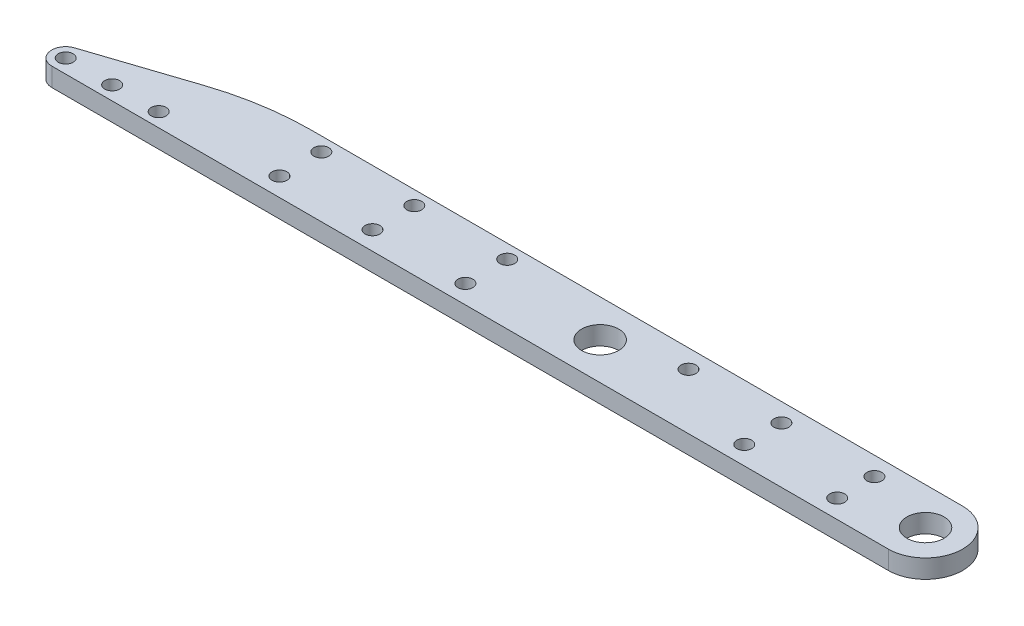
ISO-10303-21;
HEADER;
FILE_DESCRIPTION(('STEP AP214'),'2;1');
FILE_NAME('part.step','',(''),(''),'','','');
FILE_SCHEMA(('AUTOMOTIVE_DESIGN { 1 0 10303 214 1 1 1 1 }'));
ENDSEC;
DATA;
#1=APPLICATION_CONTEXT('core data for automotive mechanical design processes');
#2=APPLICATION_PROTOCOL_DEFINITION('international standard','automotive_design',2000,#1);
#3=PRODUCT_CONTEXT('',#1,'mechanical');
#4=PRODUCT('Part','Part','',(#3));
#5=PRODUCT_RELATED_PRODUCT_CATEGORY('part','',(#4));
#6=PRODUCT_DEFINITION_FORMATION('','',#4);
#7=PRODUCT_DEFINITION_CONTEXT('part definition',#1,'design');
#8=PRODUCT_DEFINITION('design','',#6,#7);
#9=PRODUCT_DEFINITION_SHAPE('','',#8);
#10=(LENGTH_UNIT() NAMED_UNIT(*) SI_UNIT(.MILLI.,.METRE.));
#11=(NAMED_UNIT(*) PLANE_ANGLE_UNIT() SI_UNIT($,.RADIAN.));
#12=(NAMED_UNIT(*) SI_UNIT($,.STERADIAN.) SOLID_ANGLE_UNIT());
#13=UNCERTAINTY_MEASURE_WITH_UNIT(LENGTH_MEASURE(1.E-05),#10,'distance_accuracy_value','');
#14=(GEOMETRIC_REPRESENTATION_CONTEXT(3) GLOBAL_UNCERTAINTY_ASSIGNED_CONTEXT((#13)) GLOBAL_UNIT_ASSIGNED_CONTEXT((#10,
#11,#12)) REPRESENTATION_CONTEXT('',''));
#15=CARTESIAN_POINT('',(0.,0.,0.));
#16=DIRECTION('',(0.,0.,1.));
#17=DIRECTION('',(1.,0.,0.));
#18=AXIS2_PLACEMENT_3D('',#15,#16,#17);
#19=CARTESIAN_POINT('',(0.,4.,0.));
#20=DIRECTION('',(0.,-1.,0.));
#21=DIRECTION('',(0.,0.,-1.));
#22=AXIS2_PLACEMENT_3D('',#19,#20,#21);
#23=PLANE('',#22);
#24=CARTESIAN_POINT('',(-94.9999999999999,4.,4.));
#25=DIRECTION('',(0.,1.,0.));
#26=DIRECTION('',(0.,0.,1.));
#27=AXIS2_PLACEMENT_3D('',#24,#25,#26);
#28=CIRCLE('',#27,1.60000000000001);
#29=CARTESIAN_POINT('',(-94.9999999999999,4.,5.60000000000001));
#30=VERTEX_POINT('',#29);
#31=EDGE_CURVE('E264',#30,#30,#28,.T.);
#32=ORIENTED_EDGE('',*,*,#31,.F.);
#33=EDGE_LOOP('',(#32));
#34=FACE_BOUND('',#33,.T.);
#35=CARTESIAN_POINT('',(-35.,4.,4.));
#36=DIRECTION('',(0.,1.,0.));
#37=DIRECTION('',(0.,0.,1.));
#38=AXIS2_PLACEMENT_3D('',#35,#36,#37);
#39=CIRCLE('',#38,1.60000000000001);
#40=CARTESIAN_POINT('',(-35.,4.,5.60000000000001));
#41=VERTEX_POINT('',#40);
#42=EDGE_CURVE('E271',#41,#41,#39,.T.);
#43=ORIENTED_EDGE('',*,*,#42,.F.);
#44=EDGE_LOOP('',(#43));
#45=FACE_BOUND('',#44,.T.);
#46=CARTESIAN_POINT('',(-14.9999999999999,4.,4.));
#47=DIRECTION('',(0.,1.,0.));
#48=DIRECTION('',(0.,0.,1.));
#49=AXIS2_PLACEMENT_3D('',#46,#47,#48);
#50=CIRCLE('',#49,1.60000000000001);
#51=CARTESIAN_POINT('',(-14.9999999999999,4.,5.60000000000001));
#52=VERTEX_POINT('',#51);
#53=EDGE_CURVE('E255',#52,#52,#50,.T.);
#54=ORIENTED_EDGE('',*,*,#53,.F.);
#55=EDGE_LOOP('',(#54));
#56=FACE_BOUND('',#55,.T.);
#57=CARTESIAN_POINT('',(-55.,4.,-3.99999999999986));
#58=DIRECTION('',(0.,1.,0.));
#59=DIRECTION('',(0.,0.,1.));
#60=AXIS2_PLACEMENT_3D('',#57,#58,#59);
#61=CIRCLE('',#60,1.59999999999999);
#62=CARTESIAN_POINT('',(-55.,4.,-2.39999999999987));
#63=VERTEX_POINT('',#62);
#64=EDGE_CURVE('E245',#63,#63,#61,.T.);
#65=ORIENTED_EDGE('',*,*,#64,.F.);
#66=EDGE_LOOP('',(#65));
#67=FACE_BOUND('',#66,.T.);
#68=CARTESIAN_POINT('',(-115.,4.,4.));
#69=DIRECTION('',(0.,1.,0.));
#70=DIRECTION('',(0.,0.,1.));
#71=AXIS2_PLACEMENT_3D('',#68,#69,#70);
#72=CIRCLE('',#71,1.60000000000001);
#73=CARTESIAN_POINT('',(-115.,4.,5.60000000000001));
#74=VERTEX_POINT('',#73);
#75=EDGE_CURVE('E295',#74,#74,#72,.T.);
#76=ORIENTED_EDGE('',*,*,#75,.F.);
#77=EDGE_LOOP('',(#76));
#78=FACE_BOUND('',#77,.T.);
#79=CARTESIAN_POINT('',(-135.,4.,4.));
#80=DIRECTION('',(0.,1.,0.));
#81=DIRECTION('',(0.,0.,1.));
#82=AXIS2_PLACEMENT_3D('',#79,#80,#81);
#83=CIRCLE('',#82,1.59999999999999);
#84=CARTESIAN_POINT('',(-135.,4.,5.59999999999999));
#85=VERTEX_POINT('',#84);
#86=EDGE_CURVE('E289',#85,#85,#83,.T.);
#87=ORIENTED_EDGE('',*,*,#86,.F.);
#88=EDGE_LOOP('',(#87));
#89=FACE_BOUND('',#88,.T.);
#90=CARTESIAN_POINT('',(-95.,4.,-5.));
#91=DIRECTION('',(0.,1.,0.));
#92=DIRECTION('',(0.,0.,1.));
#93=AXIS2_PLACEMENT_3D('',#90,#91,#92);
#94=CIRCLE('',#93,1.60000000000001);
#95=CARTESIAN_POINT('',(-95.,4.,-3.4));
#96=VERTEX_POINT('',#95);
#97=EDGE_CURVE('E283',#96,#96,#94,.T.);
#98=ORIENTED_EDGE('',*,*,#97,.F.);
#99=EDGE_LOOP('',(#98));
#100=FACE_BOUND('',#99,.T.);
#101=CARTESIAN_POINT('',(-115.,4.,-5.));
#102=DIRECTION('',(0.,1.,0.));
#103=DIRECTION('',(0.,0.,1.));
#104=AXIS2_PLACEMENT_3D('',#101,#102,#103);
#105=CIRCLE('',#104,1.60000000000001);
#106=CARTESIAN_POINT('',(-115.,4.,-3.4));
#107=VERTEX_POINT('',#106);
#108=EDGE_CURVE('E276',#107,#107,#105,.T.);
#109=ORIENTED_EDGE('',*,*,#108,.F.);
#110=EDGE_LOOP('',(#109));
#111=FACE_BOUND('',#110,.T.);
#112=CARTESIAN_POINT('',(-35.,4.,-3.99999999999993));
#113=DIRECTION('',(0.,1.,0.));
#114=DIRECTION('',(0.,0.,1.));
#115=AXIS2_PLACEMENT_3D('',#112,#113,#114);
#116=CIRCLE('',#115,1.60000000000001);
#117=CARTESIAN_POINT('',(-35.,4.,-2.39999999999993));
#118=VERTEX_POINT('',#117);
#119=EDGE_CURVE('E240',#118,#118,#116,.T.);
#120=ORIENTED_EDGE('',*,*,#119,.F.);
#121=EDGE_LOOP('',(#120));
#122=FACE_BOUND('',#121,.T.);
#123=CARTESIAN_POINT('',(-15.,4.,-4.));
#124=DIRECTION('',(0.,1.,0.));
#125=DIRECTION('',(0.,0.,1.));
#126=AXIS2_PLACEMENT_3D('',#123,#124,#125);
#127=CIRCLE('',#126,1.60000000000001);
#128=CARTESIAN_POINT('',(-15.,4.,-2.4));
#129=VERTEX_POINT('',#128);
#130=EDGE_CURVE('E247',#129,#129,#127,.T.);
#131=ORIENTED_EDGE('',*,*,#130,.F.);
#132=EDGE_LOOP('',(#131));
#133=FACE_BOUND('',#132,.T.);
#134=CARTESIAN_POINT('',(-135.,4.,-5.));
#135=DIRECTION('',(0.,1.,0.));
#136=DIRECTION('',(0.,0.,1.));
#137=AXIS2_PLACEMENT_3D('',#134,#135,#136);
#138=CIRCLE('',#137,1.59999999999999);
#139=CARTESIAN_POINT('',(-135.,4.,-3.40000000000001));
#140=VERTEX_POINT('',#139);
#141=EDGE_CURVE('E279',#140,#140,#138,.T.);
#142=ORIENTED_EDGE('',*,*,#141,.F.);
#143=EDGE_LOOP('',(#142));
#144=FACE_BOUND('',#143,.T.);
#145=CARTESIAN_POINT('',(0.,4.,0.));
#146=DIRECTION('',(0.,1.,0.));
#147=DIRECTION('',(0.,0.,-1.));
#148=AXIS2_PLACEMENT_3D('',#145,#146,#147);
#149=CIRCLE('',#148,8.);
#150=CARTESIAN_POINT('',(0.,4.,8.));
#151=VERTEX_POINT('',#150);
#152=CARTESIAN_POINT('',(0.,4.,-8.));
#153=VERTEX_POINT('',#152);
#154=EDGE_CURVE('E137',#151,#153,#149,.T.);
#155=ORIENTED_EDGE('',*,*,#154,.T.);
#156=DIRECTION('',(-1.,0.,0.));
#157=VECTOR('',#156,1.);
#158=CARTESIAN_POINT('',(-140.,4.,-8.00000000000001));
#159=LINE('',#158,#157);
#160=CARTESIAN_POINT('',(-140.,4.,-8.00000000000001));
#161=VERTEX_POINT('',#160);
#162=EDGE_CURVE('E95',#153,#161,#159,.T.);
#163=ORIENTED_EDGE('',*,*,#162,.T.);
#164=CARTESIAN_POINT('',(-140.,4.,55.6702644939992));
#165=DIRECTION('',(0.,1.,0.));
#166=DIRECTION('',(0.,0.,-1.));
#167=AXIS2_PLACEMENT_3D('',#164,#165,#166);
#168=CIRCLE('',#167,63.6702644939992);
#169=CARTESIAN_POINT('',(-160.,4.,-4.77725473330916));
#170=VERTEX_POINT('',#169);
#171=EDGE_CURVE('E108',#161,#170,#168,.T.);
#172=ORIENTED_EDGE('',*,*,#171,.T.);
#173=DIRECTION('',(-0.94938382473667,0.,0.314118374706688));
#174=VECTOR('',#173,1.);
#175=CARTESIAN_POINT('',(-180.94235512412,4.,2.15184852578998));
#176=LINE('',#175,#174);
#177=CARTESIAN_POINT('',(-180.94235512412,4.,2.15184852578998));
#178=VERTEX_POINT('',#177);
#179=EDGE_CURVE('E102',#170,#178,#176,.T.);
#180=ORIENTED_EDGE('',*,*,#179,.T.);
#181=CARTESIAN_POINT('',(-180.,4.,5.));
#182=DIRECTION('',(0.,1.,0.));
#183=DIRECTION('',(0.,0.,-1.));
#184=AXIS2_PLACEMENT_3D('',#181,#182,#183);
#185=CIRCLE('',#184,3.);
#186=CARTESIAN_POINT('',(-180.,4.,8.));
#187=VERTEX_POINT('',#186);
#188=EDGE_CURVE('E106',#178,#187,#185,.T.);
#189=ORIENTED_EDGE('',*,*,#188,.T.);
#190=DIRECTION('',(1.,0.,0.));
#191=VECTOR('',#190,1.);
#192=CARTESIAN_POINT('',(0.,4.,8.));
#193=LINE('',#192,#191);
#194=EDGE_CURVE('E58',#187,#151,#193,.T.);
#195=ORIENTED_EDGE('',*,*,#194,.T.);
#196=EDGE_LOOP('',(#155,#163,#172,#180,#189,#195));
#197=FACE_BOUND('',#196,.T.);
#198=CARTESIAN_POINT('',(0.,4.,0.));
#199=DIRECTION('',(0.,1.,0.));
#200=DIRECTION('',(0.,0.,1.));
#201=AXIS2_PLACEMENT_3D('',#198,#199,#200);
#202=CIRCLE('',#201,4.);
#203=CARTESIAN_POINT('',(0.,4.,4.));
#204=VERTEX_POINT('',#203);
#205=EDGE_CURVE('E130',#204,#204,#202,.T.);
#206=ORIENTED_EDGE('',*,*,#205,.F.);
#207=EDGE_LOOP('',(#206));
#208=FACE_BOUND('',#207,.T.);
#209=CARTESIAN_POINT('',(-70.,4.,0.));
#210=DIRECTION('',(0.,1.,0.));
#211=DIRECTION('',(0.,0.,1.));
#212=AXIS2_PLACEMENT_3D('',#209,#210,#211);
#213=CIRCLE('',#212,4.00000000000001);
#214=CARTESIAN_POINT('',(-70.,4.,4.00000000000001));
#215=VERTEX_POINT('',#214);
#216=EDGE_CURVE('E324',#215,#215,#213,.T.);
#217=ORIENTED_EDGE('',*,*,#216,.F.);
#218=EDGE_LOOP('',(#217));
#219=FACE_BOUND('',#218,.T.);
#220=CARTESIAN_POINT('',(-180.,4.,5.));
#221=DIRECTION('',(0.,1.,0.));
#222=DIRECTION('',(0.,0.,1.));
#223=AXIS2_PLACEMENT_3D('',#220,#221,#222);
#224=CIRCLE('',#223,1.59999999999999);
#225=CARTESIAN_POINT('',(-180.,4.,6.59999999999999));
#226=VERTEX_POINT('',#225);
#227=EDGE_CURVE('E318',#226,#226,#224,.T.);
#228=ORIENTED_EDGE('',*,*,#227,.F.);
#229=EDGE_LOOP('',(#228));
#230=FACE_BOUND('',#229,.T.);
#231=CARTESIAN_POINT('',(-170.,4.,5.));
#232=DIRECTION('',(0.,1.,0.));
#233=DIRECTION('',(0.,0.,1.));
#234=AXIS2_PLACEMENT_3D('',#231,#232,#233);
#235=CIRCLE('',#234,1.59999999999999);
#236=CARTESIAN_POINT('',(-170.,4.,6.59999999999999));
#237=VERTEX_POINT('',#236);
#238=EDGE_CURVE('E312',#237,#237,#235,.T.);
#239=ORIENTED_EDGE('',*,*,#238,.F.);
#240=EDGE_LOOP('',(#239));
#241=FACE_BOUND('',#240,.T.);
#242=CARTESIAN_POINT('',(-160.,4.,5.));
#243=DIRECTION('',(0.,1.,0.));
#244=DIRECTION('',(0.,0.,1.));
#245=AXIS2_PLACEMENT_3D('',#242,#243,#244);
#246=CIRCLE('',#245,1.60000000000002);
#247=CARTESIAN_POINT('',(-160.,4.,6.60000000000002));
#248=VERTEX_POINT('',#247);
#249=EDGE_CURVE('E306',#248,#248,#246,.T.);
#250=ORIENTED_EDGE('',*,*,#249,.F.);
#251=EDGE_LOOP('',(#250));
#252=FACE_BOUND('',#251,.T.);
#253=ADVANCED_FACE('F41',(#34,#45,#56,#67,#78,#89,#100,#111,#122,#133,#144,#197,#208,#219,#230,
#241,#252),#23,.F.);
#254=CARTESIAN_POINT('',(0.,0.,0.));
#255=DIRECTION('',(0.,-1.,0.));
#256=DIRECTION('',(0.,0.,-1.));
#257=AXIS2_PLACEMENT_3D('',#254,#255,#256);
#258=PLANE('',#257);
#259=CARTESIAN_POINT('',(-94.9999999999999,0.,4.));
#260=DIRECTION('',(0.,1.,0.));
#261=DIRECTION('',(0.,0.,1.));
#262=AXIS2_PLACEMENT_3D('',#259,#260,#261);
#263=CIRCLE('',#262,1.60000000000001);
#264=CARTESIAN_POINT('',(-94.9999999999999,0.,5.60000000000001));
#265=VERTEX_POINT('',#264);
#266=EDGE_CURVE('E268',#265,#265,#263,.T.);
#267=ORIENTED_EDGE('',*,*,#266,.T.);
#268=EDGE_LOOP('',(#267));
#269=FACE_BOUND('',#268,.T.);
#270=CARTESIAN_POINT('',(-35.,0.,4.));
#271=DIRECTION('',(0.,1.,0.));
#272=DIRECTION('',(0.,0.,1.));
#273=AXIS2_PLACEMENT_3D('',#270,#271,#272);
#274=CIRCLE('',#273,1.60000000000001);
#275=CARTESIAN_POINT('',(-35.,0.,5.60000000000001));
#276=VERTEX_POINT('',#275);
#277=EDGE_CURVE('E258',#276,#276,#274,.T.);
#278=ORIENTED_EDGE('',*,*,#277,.T.);
#279=EDGE_LOOP('',(#278));
#280=FACE_BOUND('',#279,.T.);
#281=CARTESIAN_POINT('',(-14.9999999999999,0.,4.));
#282=DIRECTION('',(0.,1.,0.));
#283=DIRECTION('',(0.,0.,1.));
#284=AXIS2_PLACEMENT_3D('',#281,#282,#283);
#285=CIRCLE('',#284,1.60000000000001);
#286=CARTESIAN_POINT('',(-14.9999999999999,0.,5.60000000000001));
#287=VERTEX_POINT('',#286);
#288=EDGE_CURVE('E259',#287,#287,#285,.T.);
#289=ORIENTED_EDGE('',*,*,#288,.T.);
#290=EDGE_LOOP('',(#289));
#291=FACE_BOUND('',#290,.T.);
#292=CARTESIAN_POINT('',(-55.,0.,-3.99999999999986));
#293=DIRECTION('',(0.,1.,0.));
#294=DIRECTION('',(0.,0.,1.));
#295=AXIS2_PLACEMENT_3D('',#292,#293,#294);
#296=CIRCLE('',#295,1.59999999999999);
#297=CARTESIAN_POINT('',(-55.,0.,-2.39999999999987));
#298=VERTEX_POINT('',#297);
#299=EDGE_CURVE('E242',#298,#298,#296,.T.);
#300=ORIENTED_EDGE('',*,*,#299,.T.);
#301=EDGE_LOOP('',(#300));
#302=FACE_BOUND('',#301,.T.);
#303=CARTESIAN_POINT('',(-115.,0.,4.));
#304=DIRECTION('',(0.,1.,0.));
#305=DIRECTION('',(0.,0.,1.));
#306=AXIS2_PLACEMENT_3D('',#303,#304,#305);
#307=CIRCLE('',#306,1.60000000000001);
#308=CARTESIAN_POINT('',(-115.,0.,5.60000000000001));
#309=VERTEX_POINT('',#308);
#310=EDGE_CURVE('E267',#309,#309,#307,.T.);
#311=ORIENTED_EDGE('',*,*,#310,.T.);
#312=EDGE_LOOP('',(#311));
#313=FACE_BOUND('',#312,.T.);
#314=CARTESIAN_POINT('',(-135.,0.,4.));
#315=DIRECTION('',(0.,1.,0.));
#316=DIRECTION('',(0.,0.,1.));
#317=AXIS2_PLACEMENT_3D('',#314,#315,#316);
#318=CIRCLE('',#317,1.59999999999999);
#319=CARTESIAN_POINT('',(-135.,0.,5.59999999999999));
#320=VERTEX_POINT('',#319);
#321=EDGE_CURVE('E292',#320,#320,#318,.T.);
#322=ORIENTED_EDGE('',*,*,#321,.T.);
#323=EDGE_LOOP('',(#322));
#324=FACE_BOUND('',#323,.T.);
#325=CARTESIAN_POINT('',(-95.,0.,-5.));
#326=DIRECTION('',(0.,1.,0.));
#327=DIRECTION('',(0.,0.,1.));
#328=AXIS2_PLACEMENT_3D('',#325,#326,#327);
#329=CIRCLE('',#328,1.60000000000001);
#330=CARTESIAN_POINT('',(-95.,0.,-3.4));
#331=VERTEX_POINT('',#330);
#332=EDGE_CURVE('E286',#331,#331,#329,.T.);
#333=ORIENTED_EDGE('',*,*,#332,.T.);
#334=EDGE_LOOP('',(#333));
#335=FACE_BOUND('',#334,.T.);
#336=CARTESIAN_POINT('',(-115.,0.,-5.));
#337=DIRECTION('',(0.,1.,0.));
#338=DIRECTION('',(0.,0.,1.));
#339=AXIS2_PLACEMENT_3D('',#336,#337,#338);
#340=CIRCLE('',#339,1.60000000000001);
#341=CARTESIAN_POINT('',(-115.,0.,-3.4));
#342=VERTEX_POINT('',#341);
#343=EDGE_CURVE('E280',#342,#342,#340,.T.);
#344=ORIENTED_EDGE('',*,*,#343,.T.);
#345=EDGE_LOOP('',(#344));
#346=FACE_BOUND('',#345,.T.);
#347=CARTESIAN_POINT('',(-35.,0.,-3.99999999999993));
#348=DIRECTION('',(0.,1.,0.));
#349=DIRECTION('',(0.,0.,1.));
#350=AXIS2_PLACEMENT_3D('',#347,#348,#349);
#351=CIRCLE('',#350,1.60000000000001);
#352=CARTESIAN_POINT('',(-35.,0.,-2.39999999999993));
#353=VERTEX_POINT('',#352);
#354=EDGE_CURVE('E237',#353,#353,#351,.T.);
#355=ORIENTED_EDGE('',*,*,#354,.T.);
#356=EDGE_LOOP('',(#355));
#357=FACE_BOUND('',#356,.T.);
#358=CARTESIAN_POINT('',(-15.,0.,-4.));
#359=DIRECTION('',(0.,1.,0.));
#360=DIRECTION('',(0.,0.,1.));
#361=AXIS2_PLACEMENT_3D('',#358,#359,#360);
#362=CIRCLE('',#361,1.60000000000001);
#363=CARTESIAN_POINT('',(-15.,0.,-2.4));
#364=VERTEX_POINT('',#363);
#365=EDGE_CURVE('E252',#364,#364,#362,.T.);
#366=ORIENTED_EDGE('',*,*,#365,.T.);
#367=EDGE_LOOP('',(#366));
#368=FACE_BOUND('',#367,.T.);
#369=CARTESIAN_POINT('',(-135.,0.,-5.));
#370=DIRECTION('',(0.,1.,0.));
#371=DIRECTION('',(0.,0.,1.));
#372=AXIS2_PLACEMENT_3D('',#369,#370,#371);
#373=CIRCLE('',#372,1.59999999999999);
#374=CARTESIAN_POINT('',(-135.,0.,-3.40000000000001));
#375=VERTEX_POINT('',#374);
#376=EDGE_CURVE('E300',#375,#375,#373,.T.);
#377=ORIENTED_EDGE('',*,*,#376,.T.);
#378=EDGE_LOOP('',(#377));
#379=FACE_BOUND('',#378,.T.);
#380=CARTESIAN_POINT('',(-170.,0.,5.));
#381=DIRECTION('',(0.,1.,0.));
#382=DIRECTION('',(0.,0.,1.));
#383=AXIS2_PLACEMENT_3D('',#380,#381,#382);
#384=CIRCLE('',#383,1.59999999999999);
#385=CARTESIAN_POINT('',(-170.,0.,6.59999999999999));
#386=VERTEX_POINT('',#385);
#387=EDGE_CURVE('E309',#386,#386,#384,.T.);
#388=ORIENTED_EDGE('',*,*,#387,.T.);
#389=EDGE_LOOP('',(#388));
#390=FACE_BOUND('',#389,.T.);
#391=CARTESIAN_POINT('',(-70.,0.,0.));
#392=DIRECTION('',(0.,1.,0.));
#393=DIRECTION('',(0.,0.,1.));
#394=AXIS2_PLACEMENT_3D('',#391,#392,#393);
#395=CIRCLE('',#394,4.00000000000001);
#396=CARTESIAN_POINT('',(-70.,0.,4.00000000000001));
#397=VERTEX_POINT('',#396);
#398=EDGE_CURVE('E321',#397,#397,#395,.T.);
#399=ORIENTED_EDGE('',*,*,#398,.T.);
#400=EDGE_LOOP('',(#399));
#401=FACE_BOUND('',#400,.T.);
#402=CARTESIAN_POINT('',(0.,0.,0.));
#403=DIRECTION('',(0.,1.,0.));
#404=DIRECTION('',(0.,0.,-1.));
#405=AXIS2_PLACEMENT_3D('',#402,#403,#404);
#406=CIRCLE('',#405,8.);
#407=CARTESIAN_POINT('',(0.,0.,8.));
#408=VERTEX_POINT('',#407);
#409=CARTESIAN_POINT('',(0.,0.,-8.));
#410=VERTEX_POINT('',#409);
#411=EDGE_CURVE('E126',#408,#410,#406,.T.);
#412=ORIENTED_EDGE('',*,*,#411,.F.);
#413=DIRECTION('',(1.,0.,0.));
#414=VECTOR('',#413,1.);
#415=CARTESIAN_POINT('',(0.,0.,8.));
#416=LINE('',#415,#414);
#417=CARTESIAN_POINT('',(-180.,0.,8.));
#418=VERTEX_POINT('',#417);
#419=EDGE_CURVE('E87',#418,#408,#416,.T.);
#420=ORIENTED_EDGE('',*,*,#419,.F.);
#421=CARTESIAN_POINT('',(-180.,0.,5.));
#422=DIRECTION('',(0.,1.,0.));
#423=DIRECTION('',(0.,0.,-1.));
#424=AXIS2_PLACEMENT_3D('',#421,#422,#423);
#425=CIRCLE('',#424,3.);
#426=CARTESIAN_POINT('',(-180.94235512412,0.,2.15184852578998));
#427=VERTEX_POINT('',#426);
#428=EDGE_CURVE('E81',#427,#418,#425,.T.);
#429=ORIENTED_EDGE('',*,*,#428,.F.);
#430=DIRECTION('',(-0.94938382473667,0.,0.314118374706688));
#431=VECTOR('',#430,1.);
#432=CARTESIAN_POINT('',(-180.94235512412,0.,2.15184852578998));
#433=LINE('',#432,#431);
#434=CARTESIAN_POINT('',(-160.,0.,-4.77725473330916));
#435=VERTEX_POINT('',#434);
#436=EDGE_CURVE('E116',#435,#427,#433,.T.);
#437=ORIENTED_EDGE('',*,*,#436,.F.);
#438=CARTESIAN_POINT('',(-140.,0.,55.6702644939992));
#439=DIRECTION('',(0.,1.,0.));
#440=DIRECTION('',(0.,0.,-1.));
#441=AXIS2_PLACEMENT_3D('',#438,#439,#440);
#442=CIRCLE('',#441,63.6702644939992);
#443=CARTESIAN_POINT('',(-140.,0.,-8.00000000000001));
#444=VERTEX_POINT('',#443);
#445=EDGE_CURVE('E132',#444,#435,#442,.T.);
#446=ORIENTED_EDGE('',*,*,#445,.F.);
#447=DIRECTION('',(-1.,0.,0.));
#448=VECTOR('',#447,1.);
#449=CARTESIAN_POINT('',(-140.,0.,-8.00000000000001));
#450=LINE('',#449,#448);
#451=EDGE_CURVE('E129',#410,#444,#450,.T.);
#452=ORIENTED_EDGE('',*,*,#451,.F.);
#453=EDGE_LOOP('',(#412,#420,#429,#437,#446,#452));
#454=FACE_BOUND('',#453,.T.);
#455=CARTESIAN_POINT('',(0.,0.,0.));
#456=DIRECTION('',(0.,1.,0.));
#457=DIRECTION('',(0.,0.,1.));
#458=AXIS2_PLACEMENT_3D('',#455,#456,#457);
#459=CIRCLE('',#458,4.);
#460=CARTESIAN_POINT('',(0.,0.,4.));
#461=VERTEX_POINT('',#460);
#462=EDGE_CURVE('E327',#461,#461,#459,.T.);
#463=ORIENTED_EDGE('',*,*,#462,.T.);
#464=EDGE_LOOP('',(#463));
#465=FACE_BOUND('',#464,.T.);
#466=CARTESIAN_POINT('',(-180.,0.,5.));
#467=DIRECTION('',(0.,1.,0.));
#468=DIRECTION('',(0.,0.,1.));
#469=AXIS2_PLACEMENT_3D('',#466,#467,#468);
#470=CIRCLE('',#469,1.59999999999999);
#471=CARTESIAN_POINT('',(-180.,0.,6.59999999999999));
#472=VERTEX_POINT('',#471);
#473=EDGE_CURVE('E315',#472,#472,#470,.T.);
#474=ORIENTED_EDGE('',*,*,#473,.T.);
#475=EDGE_LOOP('',(#474));
#476=FACE_BOUND('',#475,.T.);
#477=CARTESIAN_POINT('',(-160.,0.,5.));
#478=DIRECTION('',(0.,1.,0.));
#479=DIRECTION('',(0.,0.,1.));
#480=AXIS2_PLACEMENT_3D('',#477,#478,#479);
#481=CIRCLE('',#480,1.60000000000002);
#482=CARTESIAN_POINT('',(-160.,0.,6.60000000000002));
#483=VERTEX_POINT('',#482);
#484=EDGE_CURVE('E303',#483,#483,#481,.T.);
#485=ORIENTED_EDGE('',*,*,#484,.T.);
#486=EDGE_LOOP('',(#485));
#487=FACE_BOUND('',#486,.T.);
#488=ADVANCED_FACE('F146',(#269,#280,#291,#302,#313,#324,#335,#346,#357,#368,#379,#390,#401,
#454,#465,#476,#487),#258,.T.);
#489=CARTESIAN_POINT('',(0.,4.,0.));
#490=DIRECTION('',(0.,-1.,0.));
#491=DIRECTION('',(0.,0.,-1.));
#492=AXIS2_PLACEMENT_3D('',#489,#490,#491);
#493=CYLINDRICAL_SURFACE('',#492,8.);
#494=ORIENTED_EDGE('',*,*,#411,.T.);
#495=DIRECTION('',(0.,-1.,0.));
#496=VECTOR('',#495,1.);
#497=CARTESIAN_POINT('',(0.,4.,-8.));
#498=LINE('',#497,#496);
#499=EDGE_CURVE('E11',#153,#410,#498,.T.);
#500=ORIENTED_EDGE('',*,*,#499,.F.);
#501=ORIENTED_EDGE('',*,*,#154,.F.);
#502=DIRECTION('',(0.,-1.,0.));
#503=VECTOR('',#502,1.);
#504=CARTESIAN_POINT('',(0.,4.,8.));
#505=LINE('',#504,#503);
#506=EDGE_CURVE('E122',#151,#408,#505,.T.);
#507=ORIENTED_EDGE('',*,*,#506,.T.);
#508=EDGE_LOOP('',(#494,#500,#501,#507));
#509=FACE_BOUND('',#508,.T.);
#510=ADVANCED_FACE('F43',(#509),#493,.T.);
#511=CARTESIAN_POINT('',(-140.,4.,-8.00000000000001));
#512=DIRECTION('',(0.,0.,1.));
#513=DIRECTION('',(1.,0.,0.));
#514=AXIS2_PLACEMENT_3D('',#511,#512,#513);
#515=PLANE('',#514);
#516=ORIENTED_EDGE('',*,*,#451,.T.);
#517=DIRECTION('',(0.,-1.,0.));
#518=VECTOR('',#517,1.);
#519=CARTESIAN_POINT('',(-140.,4.,-8.00000000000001));
#520=LINE('',#519,#518);
#521=EDGE_CURVE('E50',#161,#444,#520,.T.);
#522=ORIENTED_EDGE('',*,*,#521,.F.);
#523=ORIENTED_EDGE('',*,*,#162,.F.);
#524=ORIENTED_EDGE('',*,*,#499,.T.);
#525=EDGE_LOOP('',(#516,#522,#523,#524));
#526=FACE_BOUND('',#525,.T.);
#527=ADVANCED_FACE('F514',(#526),#515,.F.);
#528=CARTESIAN_POINT('',(-140.,4.,55.6702644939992));
#529=DIRECTION('',(0.,-1.,0.));
#530=DIRECTION('',(0.,0.,-1.));
#531=AXIS2_PLACEMENT_3D('',#528,#529,#530);
#532=CYLINDRICAL_SURFACE('',#531,63.6702644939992);
#533=ORIENTED_EDGE('',*,*,#445,.T.);
#534=DIRECTION('',(0.,-1.,0.));
#535=VECTOR('',#534,1.);
#536=CARTESIAN_POINT('',(-160.,4.,-4.77725473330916));
#537=LINE('',#536,#535);
#538=EDGE_CURVE('E117',#170,#435,#537,.T.);
#539=ORIENTED_EDGE('',*,*,#538,.F.);
#540=ORIENTED_EDGE('',*,*,#171,.F.);
#541=ORIENTED_EDGE('',*,*,#521,.T.);
#542=EDGE_LOOP('',(#533,#539,#540,#541));
#543=FACE_BOUND('',#542,.T.);
#544=ADVANCED_FACE('F143',(#543),#532,.T.);
#545=CARTESIAN_POINT('',(-180.94235512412,4.,2.15184852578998));
#546=DIRECTION('',(0.314118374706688,0.,0.94938382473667));
#547=DIRECTION('',(0.94938382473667,0.,-0.314118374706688));
#548=AXIS2_PLACEMENT_3D('',#545,#546,#547);
#549=PLANE('',#548);
#550=ORIENTED_EDGE('',*,*,#436,.T.);
#551=DIRECTION('',(0.,-1.,0.));
#552=VECTOR('',#551,1.);
#553=CARTESIAN_POINT('',(-180.94235512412,4.,2.15184852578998));
#554=LINE('',#553,#552);
#555=EDGE_CURVE('E113',#178,#427,#554,.T.);
#556=ORIENTED_EDGE('',*,*,#555,.F.);
#557=ORIENTED_EDGE('',*,*,#179,.F.);
#558=ORIENTED_EDGE('',*,*,#538,.T.);
#559=EDGE_LOOP('',(#550,#556,#557,#558));
#560=FACE_BOUND('',#559,.T.);
#561=ADVANCED_FACE('F114',(#560),#549,.F.);
#562=CARTESIAN_POINT('',(-180.,4.,5.));
#563=DIRECTION('',(0.,-1.,0.));
#564=DIRECTION('',(0.,0.,-1.));
#565=AXIS2_PLACEMENT_3D('',#562,#563,#564);
#566=CYLINDRICAL_SURFACE('',#565,3.);
#567=ORIENTED_EDGE('',*,*,#428,.T.);
#568=DIRECTION('',(0.,-1.,0.));
#569=VECTOR('',#568,1.);
#570=CARTESIAN_POINT('',(-180.,4.,8.));
#571=LINE('',#570,#569);
#572=EDGE_CURVE('E118',#187,#418,#571,.T.);
#573=ORIENTED_EDGE('',*,*,#572,.F.);
#574=ORIENTED_EDGE('',*,*,#188,.F.);
#575=ORIENTED_EDGE('',*,*,#555,.T.);
#576=EDGE_LOOP('',(#567,#573,#574,#575));
#577=FACE_BOUND('',#576,.T.);
#578=ADVANCED_FACE('F120',(#577),#566,.T.);
#579=CARTESIAN_POINT('',(0.,4.,8.));
#580=DIRECTION('',(0.,0.,-1.));
#581=DIRECTION('',(-1.,0.,0.));
#582=AXIS2_PLACEMENT_3D('',#579,#580,#581);
#583=PLANE('',#582);
#584=ORIENTED_EDGE('',*,*,#419,.T.);
#585=ORIENTED_EDGE('',*,*,#506,.F.);
#586=ORIENTED_EDGE('',*,*,#194,.F.);
#587=ORIENTED_EDGE('',*,*,#572,.T.);
#588=EDGE_LOOP('',(#584,#585,#586,#587));
#589=FACE_BOUND('',#588,.T.);
#590=ADVANCED_FACE('F151',(#589),#583,.F.);
#591=CARTESIAN_POINT('',(0.,4.,0.));
#592=DIRECTION('',(0.,-1.,0.));
#593=DIRECTION('',(0.,0.,-1.));
#594=AXIS2_PLACEMENT_3D('',#591,#592,#593);
#595=CYLINDRICAL_SURFACE('',#594,4.);
#596=ORIENTED_EDGE('',*,*,#205,.T.);
#597=EDGE_LOOP('',(#596));
#598=FACE_BOUND('',#597,.T.);
#599=ORIENTED_EDGE('',*,*,#462,.F.);
#600=EDGE_LOOP('',(#599));
#601=FACE_BOUND('',#600,.T.);
#602=ADVANCED_FACE('F153',(#598,#601),#595,.F.);
#603=CARTESIAN_POINT('',(-70.,4.,0.));
#604=DIRECTION('',(0.,-1.,0.));
#605=DIRECTION('',(0.,0.,-1.));
#606=AXIS2_PLACEMENT_3D('',#603,#604,#605);
#607=CYLINDRICAL_SURFACE('',#606,4.00000000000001);
#608=ORIENTED_EDGE('',*,*,#216,.T.);
#609=EDGE_LOOP('',(#608));
#610=FACE_BOUND('',#609,.T.);
#611=ORIENTED_EDGE('',*,*,#398,.F.);
#612=EDGE_LOOP('',(#611));
#613=FACE_BOUND('',#612,.T.);
#614=ADVANCED_FACE('F159',(#610,#613),#607,.F.);
#615=CARTESIAN_POINT('',(-180.,4.,5.));
#616=DIRECTION('',(0.,-1.,0.));
#617=DIRECTION('',(0.,0.,-1.));
#618=AXIS2_PLACEMENT_3D('',#615,#616,#617);
#619=CYLINDRICAL_SURFACE('',#618,1.59999999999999);
#620=ORIENTED_EDGE('',*,*,#227,.T.);
#621=EDGE_LOOP('',(#620));
#622=FACE_BOUND('',#621,.T.);
#623=ORIENTED_EDGE('',*,*,#473,.F.);
#624=EDGE_LOOP('',(#623));
#625=FACE_BOUND('',#624,.T.);
#626=ADVANCED_FACE('F177',(#622,#625),#619,.F.);
#627=CARTESIAN_POINT('',(-170.,4.,5.));
#628=DIRECTION('',(0.,-1.,0.));
#629=DIRECTION('',(0.,0.,-1.));
#630=AXIS2_PLACEMENT_3D('',#627,#628,#629);
#631=CYLINDRICAL_SURFACE('',#630,1.59999999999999);
#632=ORIENTED_EDGE('',*,*,#238,.T.);
#633=EDGE_LOOP('',(#632));
#634=FACE_BOUND('',#633,.T.);
#635=ORIENTED_EDGE('',*,*,#387,.F.);
#636=EDGE_LOOP('',(#635));
#637=FACE_BOUND('',#636,.T.);
#638=ADVANCED_FACE('F181',(#634,#637),#631,.F.);
#639=CARTESIAN_POINT('',(-160.,4.,5.));
#640=DIRECTION('',(0.,-1.,0.));
#641=DIRECTION('',(0.,0.,-1.));
#642=AXIS2_PLACEMENT_3D('',#639,#640,#641);
#643=CYLINDRICAL_SURFACE('',#642,1.60000000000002);
#644=ORIENTED_EDGE('',*,*,#249,.T.);
#645=EDGE_LOOP('',(#644));
#646=FACE_BOUND('',#645,.T.);
#647=ORIENTED_EDGE('',*,*,#484,.F.);
#648=EDGE_LOOP('',(#647));
#649=FACE_BOUND('',#648,.T.);
#650=ADVANCED_FACE('F185',(#646,#649),#643,.F.);
#651=CARTESIAN_POINT('',(-135.,0.,-5.));
#652=DIRECTION('',(0.,1.,0.));
#653=DIRECTION('',(0.,0.,1.));
#654=AXIS2_PLACEMENT_3D('',#651,#652,#653);
#655=CYLINDRICAL_SURFACE('',#654,1.59999999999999);
#656=ORIENTED_EDGE('',*,*,#376,.F.);
#657=EDGE_LOOP('',(#656));
#658=FACE_BOUND('',#657,.T.);
#659=ORIENTED_EDGE('',*,*,#141,.T.);
#660=EDGE_LOOP('',(#659));
#661=FACE_BOUND('',#660,.T.);
#662=ADVANCED_FACE('F188',(#658,#661),#655,.F.);
#663=CARTESIAN_POINT('',(-15.,0.,-4.));
#664=DIRECTION('',(0.,1.,0.));
#665=DIRECTION('',(0.,0.,1.));
#666=AXIS2_PLACEMENT_3D('',#663,#664,#665);
#667=CYLINDRICAL_SURFACE('',#666,1.60000000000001);
#668=ORIENTED_EDGE('',*,*,#365,.F.);
#669=EDGE_LOOP('',(#668));
#670=FACE_BOUND('',#669,.T.);
#671=ORIENTED_EDGE('',*,*,#130,.T.);
#672=EDGE_LOOP('',(#671));
#673=FACE_BOUND('',#672,.T.);
#674=ADVANCED_FACE('F192',(#670,#673),#667,.F.);
#675=CARTESIAN_POINT('',(-35.,0.,-3.99999999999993));
#676=DIRECTION('',(0.,1.,0.));
#677=DIRECTION('',(0.,0.,1.));
#678=AXIS2_PLACEMENT_3D('',#675,#676,#677);
#679=CYLINDRICAL_SURFACE('',#678,1.60000000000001);
#680=ORIENTED_EDGE('',*,*,#354,.F.);
#681=EDGE_LOOP('',(#680));
#682=FACE_BOUND('',#681,.T.);
#683=ORIENTED_EDGE('',*,*,#119,.T.);
#684=EDGE_LOOP('',(#683));
#685=FACE_BOUND('',#684,.T.);
#686=ADVANCED_FACE('F210',(#682,#685),#679,.F.);
#687=CARTESIAN_POINT('',(-115.,0.,-5.));
#688=DIRECTION('',(0.,1.,0.));
#689=DIRECTION('',(0.,0.,1.));
#690=AXIS2_PLACEMENT_3D('',#687,#688,#689);
#691=CYLINDRICAL_SURFACE('',#690,1.60000000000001);
#692=ORIENTED_EDGE('',*,*,#343,.F.);
#693=EDGE_LOOP('',(#692));
#694=FACE_BOUND('',#693,.T.);
#695=ORIENTED_EDGE('',*,*,#108,.T.);
#696=EDGE_LOOP('',(#695));
#697=FACE_BOUND('',#696,.T.);
#698=ADVANCED_FACE('F206',(#694,#697),#691,.F.);
#699=CARTESIAN_POINT('',(-95.,0.,-5.));
#700=DIRECTION('',(0.,1.,0.));
#701=DIRECTION('',(0.,0.,1.));
#702=AXIS2_PLACEMENT_3D('',#699,#700,#701);
#703=CYLINDRICAL_SURFACE('',#702,1.60000000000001);
#704=ORIENTED_EDGE('',*,*,#332,.F.);
#705=EDGE_LOOP('',(#704));
#706=FACE_BOUND('',#705,.T.);
#707=ORIENTED_EDGE('',*,*,#97,.T.);
#708=EDGE_LOOP('',(#707));
#709=FACE_BOUND('',#708,.T.);
#710=ADVANCED_FACE('F202',(#706,#709),#703,.F.);
#711=CARTESIAN_POINT('',(-135.,0.,4.));
#712=DIRECTION('',(0.,1.,0.));
#713=DIRECTION('',(0.,0.,1.));
#714=AXIS2_PLACEMENT_3D('',#711,#712,#713);
#715=CYLINDRICAL_SURFACE('',#714,1.59999999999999);
#716=ORIENTED_EDGE('',*,*,#321,.F.);
#717=EDGE_LOOP('',(#716));
#718=FACE_BOUND('',#717,.T.);
#719=ORIENTED_EDGE('',*,*,#86,.T.);
#720=EDGE_LOOP('',(#719));
#721=FACE_BOUND('',#720,.T.);
#722=ADVANCED_FACE('F198',(#718,#721),#715,.F.);
#723=CARTESIAN_POINT('',(-115.,0.,4.));
#724=DIRECTION('',(0.,1.,0.));
#725=DIRECTION('',(0.,0.,1.));
#726=AXIS2_PLACEMENT_3D('',#723,#724,#725);
#727=CYLINDRICAL_SURFACE('',#726,1.60000000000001);
#728=ORIENTED_EDGE('',*,*,#310,.F.);
#729=EDGE_LOOP('',(#728));
#730=FACE_BOUND('',#729,.T.);
#731=ORIENTED_EDGE('',*,*,#75,.T.);
#732=EDGE_LOOP('',(#731));
#733=FACE_BOUND('',#732,.T.);
#734=ADVANCED_FACE('F194',(#730,#733),#727,.F.);
#735=CARTESIAN_POINT('',(-55.,0.,-3.99999999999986));
#736=DIRECTION('',(0.,1.,0.));
#737=DIRECTION('',(0.,0.,1.));
#738=AXIS2_PLACEMENT_3D('',#735,#736,#737);
#739=CYLINDRICAL_SURFACE('',#738,1.59999999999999);
#740=ORIENTED_EDGE('',*,*,#299,.F.);
#741=EDGE_LOOP('',(#740));
#742=FACE_BOUND('',#741,.T.);
#743=ORIENTED_EDGE('',*,*,#64,.T.);
#744=EDGE_LOOP('',(#743));
#745=FACE_BOUND('',#744,.T.);
#746=ADVANCED_FACE('F197',(#742,#745),#739,.F.);
#747=CARTESIAN_POINT('',(-14.9999999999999,0.,4.));
#748=DIRECTION('',(0.,1.,0.));
#749=DIRECTION('',(0.,0.,1.));
#750=AXIS2_PLACEMENT_3D('',#747,#748,#749);
#751=CYLINDRICAL_SURFACE('',#750,1.60000000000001);
#752=ORIENTED_EDGE('',*,*,#288,.F.);
#753=EDGE_LOOP('',(#752));
#754=FACE_BOUND('',#753,.T.);
#755=ORIENTED_EDGE('',*,*,#53,.T.);
#756=EDGE_LOOP('',(#755));
#757=FACE_BOUND('',#756,.T.);
#758=ADVANCED_FACE('F216',(#754,#757),#751,.F.);
#759=CARTESIAN_POINT('',(-35.,0.,4.));
#760=DIRECTION('',(0.,1.,0.));
#761=DIRECTION('',(0.,0.,1.));
#762=AXIS2_PLACEMENT_3D('',#759,#760,#761);
#763=CYLINDRICAL_SURFACE('',#762,1.60000000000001);
#764=ORIENTED_EDGE('',*,*,#277,.F.);
#765=EDGE_LOOP('',(#764));
#766=FACE_BOUND('',#765,.T.);
#767=ORIENTED_EDGE('',*,*,#42,.T.);
#768=EDGE_LOOP('',(#767));
#769=FACE_BOUND('',#768,.T.);
#770=ADVANCED_FACE('F212',(#766,#769),#763,.F.);
#771=CARTESIAN_POINT('',(-94.9999999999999,0.,4.));
#772=DIRECTION('',(0.,1.,0.));
#773=DIRECTION('',(0.,0.,1.));
#774=AXIS2_PLACEMENT_3D('',#771,#772,#773);
#775=CYLINDRICAL_SURFACE('',#774,1.60000000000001);
#776=ORIENTED_EDGE('',*,*,#266,.F.);
#777=EDGE_LOOP('',(#776));
#778=FACE_BOUND('',#777,.T.);
#779=ORIENTED_EDGE('',*,*,#31,.T.);
#780=EDGE_LOOP('',(#779));
#781=FACE_BOUND('',#780,.T.);
#782=ADVANCED_FACE('F215',(#778,#781),#775,.F.);
#783=CLOSED_SHELL('',(#253,#488,#510,#527,#544,#561,#578,#590,#602,#614,#626,#638,#650,#662,
#674,#686,#698,#710,#722,#734,#746,#758,#770,#782));
#784=MANIFOLD_SOLID_BREP('B2',#783);
#785=ADVANCED_BREP_SHAPE_REPRESENTATION('',(#18,#784),#14);
#786=SHAPE_DEFINITION_REPRESENTATION(#9,#785);
ENDSEC;
END-ISO-10303-21;
